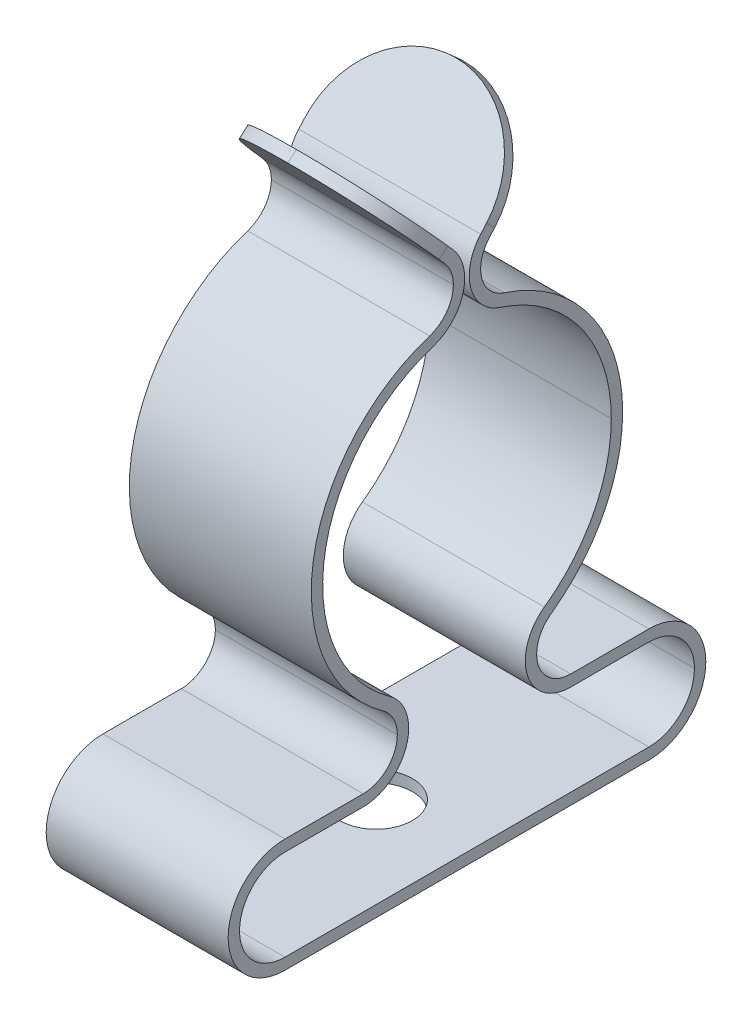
ISO-10303-21;
HEADER;
FILE_DESCRIPTION(('STEP AP214'),'2;1');
FILE_NAME('part.step','',(''),(''),'','','');
FILE_SCHEMA(('AUTOMOTIVE_DESIGN { 1 0 10303 214 1 1 1 1 }'));
ENDSEC;
DATA;
#1=APPLICATION_CONTEXT('core data for automotive mechanical design processes');
#2=APPLICATION_PROTOCOL_DEFINITION('international standard','automotive_design',2000,#1);
#3=PRODUCT_CONTEXT('',#1,'mechanical');
#4=PRODUCT('Part','Part','',(#3));
#5=PRODUCT_RELATED_PRODUCT_CATEGORY('part','',(#4));
#6=PRODUCT_DEFINITION_FORMATION('','',#4);
#7=PRODUCT_DEFINITION_CONTEXT('part definition',#1,'design');
#8=PRODUCT_DEFINITION('design','',#6,#7);
#9=PRODUCT_DEFINITION_SHAPE('','',#8);
#10=(LENGTH_UNIT() NAMED_UNIT(*) SI_UNIT(.MILLI.,.METRE.));
#11=(NAMED_UNIT(*) PLANE_ANGLE_UNIT() SI_UNIT($,.RADIAN.));
#12=(NAMED_UNIT(*) SI_UNIT($,.STERADIAN.) SOLID_ANGLE_UNIT());
#13=UNCERTAINTY_MEASURE_WITH_UNIT(LENGTH_MEASURE(1.E-05),#10,'distance_accuracy_value','');
#14=(GEOMETRIC_REPRESENTATION_CONTEXT(3) GLOBAL_UNCERTAINTY_ASSIGNED_CONTEXT((#13)) GLOBAL_UNIT_ASSIGNED_CONTEXT((#10,
#11,#12)) REPRESENTATION_CONTEXT('',''));
#15=CARTESIAN_POINT('',(0.,0.,0.));
#16=DIRECTION('',(0.,0.,1.));
#17=DIRECTION('',(1.,0.,0.));
#18=AXIS2_PLACEMENT_3D('',#15,#16,#17);
#19=CARTESIAN_POINT('',(17.3911017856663,37.8962384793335,19.6169356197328));
#20=DIRECTION('',(0.,-0.662703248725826,0.74888210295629));
#21=DIRECTION('',(0.,0.74888210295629,0.662703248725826));
#22=AXIS2_PLACEMENT_3D('',#19,#20,#21);
#23=CYLINDRICAL_SURFACE('',#22,4.);
#24=CARTESIAN_POINT('',(17.3911017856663,39.2216449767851,18.1191714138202));
#25=DIRECTION('',(0.,0.662703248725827,-0.74888210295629));
#26=DIRECTION('',(0.,-0.74888210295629,-0.662703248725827));
#27=AXIS2_PLACEMENT_3D('',#24,#25,#26);
#28=CIRCLE('',#27,4.);
#29=CARTESIAN_POINT('',(17.3911017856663,42.2171733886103,20.7699844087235));
#30=VERTEX_POINT('',#29);
#31=CARTESIAN_POINT('',(21.3911017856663,39.2216449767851,18.1191714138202));
#32=VERTEX_POINT('',#31);
#33=EDGE_CURVE('E597',#30,#32,#28,.T.);
#34=ORIENTED_EDGE('',*,*,#33,.F.);
#35=DIRECTION('',(0.,-0.662703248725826,0.74888210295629));
#36=VECTOR('',#35,1.);
#37=CARTESIAN_POINT('',(17.3911017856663,41.8858217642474,21.1444254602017));
#38=LINE('',#37,#36);
#39=CARTESIAN_POINT('',(17.3911017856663,41.8858217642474,21.1444254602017));
#40=VERTEX_POINT('',#39);
#41=EDGE_CURVE('E10',#30,#40,#38,.T.);
#42=ORIENTED_EDGE('',*,*,#41,.T.);
#43=CARTESIAN_POINT('',(17.3911017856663,38.8902933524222,18.4936124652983));
#44=DIRECTION('',(0.,-0.662703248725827,0.74888210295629));
#45=DIRECTION('',(0.,-0.74888210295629,-0.662703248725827));
#46=AXIS2_PLACEMENT_3D('',#43,#44,#45);
#47=CIRCLE('',#46,4.);
#48=CARTESIAN_POINT('',(21.3911017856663,38.8902933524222,18.4936124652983));
#49=VERTEX_POINT('',#48);
#50=EDGE_CURVE('E567',#49,#40,#47,.T.);
#51=ORIENTED_EDGE('',*,*,#50,.F.);
#52=DIRECTION('',(0.,-0.662703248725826,0.74888210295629));
#53=VECTOR('',#52,1.);
#54=CARTESIAN_POINT('',(21.3911017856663,37.8962384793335,19.6169356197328));
#55=LINE('',#54,#53);
#56=EDGE_CURVE('E650',#32,#49,#55,.T.);
#57=ORIENTED_EDGE('',*,*,#56,.F.);
#58=EDGE_LOOP('',(#34,#42,#51,#57));
#59=FACE_BOUND('',#58,.T.);
#60=ADVANCED_FACE('F15',(#59),#23,.T.);
#61=CARTESIAN_POINT('',(17.3911017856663,39.2216449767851,18.1191714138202));
#62=DIRECTION('',(0.,0.662703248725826,-0.74888210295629));
#63=DIRECTION('',(0.,-0.74888210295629,-0.662703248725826));
#64=AXIS2_PLACEMENT_3D('',#61,#62,#63);
#65=CYLINDRICAL_SURFACE('',#64,4.);
#66=ORIENTED_EDGE('',*,*,#41,.F.);
#67=CARTESIAN_POINT('',(17.3911017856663,39.2216449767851,18.1191714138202));
#68=DIRECTION('',(0.,0.662703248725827,-0.74888210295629));
#69=DIRECTION('',(0.,-0.74888210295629,-0.662703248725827));
#70=AXIS2_PLACEMENT_3D('',#67,#68,#69);
#71=CIRCLE('',#70,4.);
#72=CARTESIAN_POINT('',(13.3911017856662,39.2216449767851,18.1191714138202));
#73=VERTEX_POINT('',#72);
#74=EDGE_CURVE('E590',#73,#30,#71,.T.);
#75=ORIENTED_EDGE('',*,*,#74,.F.);
#76=DIRECTION('',(0.,0.662703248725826,-0.74888210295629));
#77=VECTOR('',#76,1.);
#78=CARTESIAN_POINT('',(13.3911017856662,39.2216449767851,18.1191714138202));
#79=LINE('',#78,#77);
#80=CARTESIAN_POINT('',(13.3911017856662,38.8902933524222,18.4936124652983));
#81=VERTEX_POINT('',#80);
#82=EDGE_CURVE('E502',#81,#73,#79,.T.);
#83=ORIENTED_EDGE('',*,*,#82,.F.);
#84=CARTESIAN_POINT('',(17.3911017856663,38.8902933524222,18.4936124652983));
#85=DIRECTION('',(0.,-0.662703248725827,0.74888210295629));
#86=DIRECTION('',(0.,-0.74888210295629,-0.662703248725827));
#87=AXIS2_PLACEMENT_3D('',#84,#85,#86);
#88=CIRCLE('',#87,4.);
#89=EDGE_CURVE('E575',#40,#81,#88,.T.);
#90=ORIENTED_EDGE('',*,*,#89,.F.);
#91=EDGE_LOOP('',(#66,#75,#83,#90));
#92=FACE_BOUND('',#91,.T.);
#93=ADVANCED_FACE('F935',(#92),#65,.T.);
#94=CARTESIAN_POINT('',(17.3911017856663,39.9806422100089,17.2784956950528));
#95=DIRECTION('',(0.,0.662703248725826,0.74888210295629));
#96=DIRECTION('',(0.,0.74888210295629,-0.662703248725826));
#97=AXIS2_PLACEMENT_3D('',#94,#95,#96);
#98=CYLINDRICAL_SURFACE('',#97,4.);
#99=CARTESIAN_POINT('',(17.3911017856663,38.8902933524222,16.0463563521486));
#100=DIRECTION('',(0.,-0.662703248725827,-0.74888210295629));
#101=DIRECTION('',(0.,0.74888210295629,-0.662703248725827));
#102=AXIS2_PLACEMENT_3D('',#99,#100,#101);
#103=CIRCLE('',#102,4.);
#104=CARTESIAN_POINT('',(17.3911017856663,41.8858217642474,13.3955433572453));
#105=VERTEX_POINT('',#104);
#106=CARTESIAN_POINT('',(21.3911017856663,38.8902933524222,16.0463563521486));
#107=VERTEX_POINT('',#106);
#108=EDGE_CURVE('E695',#105,#107,#103,.T.);
#109=ORIENTED_EDGE('',*,*,#108,.F.);
#110=DIRECTION('',(0.,0.662703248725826,0.74888210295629));
#111=VECTOR('',#110,1.);
#112=CARTESIAN_POINT('',(17.3911017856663,42.2171733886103,13.7699844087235));
#113=LINE('',#112,#111);
#114=CARTESIAN_POINT('',(17.3911017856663,42.2171733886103,13.7699844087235));
#115=VERTEX_POINT('',#114);
#116=EDGE_CURVE('E24',#105,#115,#113,.T.);
#117=ORIENTED_EDGE('',*,*,#116,.T.);
#118=CARTESIAN_POINT('',(17.3911017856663,39.2216449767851,16.4207974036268));
#119=DIRECTION('',(0.,0.662703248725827,0.74888210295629));
#120=DIRECTION('',(0.,0.74888210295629,-0.662703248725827));
#121=AXIS2_PLACEMENT_3D('',#118,#119,#120);
#122=CIRCLE('',#121,4.);
#123=CARTESIAN_POINT('',(21.3911017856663,39.2216449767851,16.4207974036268));
#124=VERTEX_POINT('',#123);
#125=EDGE_CURVE('E443',#124,#115,#122,.T.);
#126=ORIENTED_EDGE('',*,*,#125,.F.);
#127=DIRECTION('',(0.,0.662703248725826,0.74888210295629));
#128=VECTOR('',#127,1.);
#129=CARTESIAN_POINT('',(21.3911017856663,39.9806422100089,17.2784956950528));
#130=LINE('',#129,#128);
#131=EDGE_CURVE('E608',#107,#124,#130,.T.);
#132=ORIENTED_EDGE('',*,*,#131,.F.);
#133=EDGE_LOOP('',(#109,#117,#126,#132));
#134=FACE_BOUND('',#133,.T.);
#135=ADVANCED_FACE('F758',(#134),#98,.T.);
#136=CARTESIAN_POINT('',(17.3911017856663,38.8902933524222,16.0463563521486));
#137=DIRECTION('',(0.,-0.662703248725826,-0.74888210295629));
#138=DIRECTION('',(0.,-0.74888210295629,0.662703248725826));
#139=AXIS2_PLACEMENT_3D('',#136,#137,#138);
#140=CYLINDRICAL_SURFACE('',#139,4.);
#141=ORIENTED_EDGE('',*,*,#116,.F.);
#142=CARTESIAN_POINT('',(17.3911017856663,38.8902933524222,16.0463563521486));
#143=DIRECTION('',(0.,-0.662703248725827,-0.74888210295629));
#144=DIRECTION('',(0.,0.74888210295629,-0.662703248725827));
#145=AXIS2_PLACEMENT_3D('',#142,#143,#144);
#146=CIRCLE('',#145,4.);
#147=CARTESIAN_POINT('',(13.3911017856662,38.8902933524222,16.0463563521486));
#148=VERTEX_POINT('',#147);
#149=EDGE_CURVE('E468',#148,#105,#146,.T.);
#150=ORIENTED_EDGE('',*,*,#149,.F.);
#151=DIRECTION('',(0.,-0.662703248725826,-0.74888210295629));
#152=VECTOR('',#151,1.);
#153=CARTESIAN_POINT('',(13.3911017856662,38.8902933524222,16.0463563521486));
#154=LINE('',#153,#152);
#155=CARTESIAN_POINT('',(13.3911017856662,39.2216449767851,16.4207974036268));
#156=VERTEX_POINT('',#155);
#157=EDGE_CURVE('E499',#156,#148,#154,.T.);
#158=ORIENTED_EDGE('',*,*,#157,.F.);
#159=CARTESIAN_POINT('',(17.3911017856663,39.2216449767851,16.4207974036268));
#160=DIRECTION('',(0.,0.662703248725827,0.74888210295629));
#161=DIRECTION('',(0.,0.74888210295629,-0.662703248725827));
#162=AXIS2_PLACEMENT_3D('',#159,#160,#161);
#163=CIRCLE('',#162,4.);
#164=EDGE_CURVE('E447',#115,#156,#163,.T.);
#165=ORIENTED_EDGE('',*,*,#164,.F.);
#166=EDGE_LOOP('',(#141,#150,#158,#165));
#167=FACE_BOUND('',#166,.T.);
#168=ADVANCED_FACE('F762',(#167),#140,.T.);
#169=CARTESIAN_POINT('',(17.3911017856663,20.2426567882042,17.2699844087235));
#170=DIRECTION('',(0.,-1.,0.));
#171=DIRECTION('',(1.,0.,0.));
#172=AXIS2_PLACEMENT_3D('',#169,#170,#171);
#173=CYLINDRICAL_SURFACE('',#172,1.6);
#174=DIRECTION('',(0.,-1.,0.));
#175=VECTOR('',#174,1.);
#176=CARTESIAN_POINT('',(15.7911017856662,20.2426567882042,17.2699844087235));
#177=LINE('',#176,#175);
#178=CARTESIAN_POINT('',(15.7911017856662,15.7171733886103,17.2699844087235));
#179=VERTEX_POINT('',#178);
#180=CARTESIAN_POINT('',(15.7911017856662,15.2171733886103,17.2699844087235));
#181=VERTEX_POINT('',#180);
#182=EDGE_CURVE('E905',#179,#181,#177,.T.);
#183=ORIENTED_EDGE('',*,*,#182,.F.);
#184=CARTESIAN_POINT('',(17.3911017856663,15.7171733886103,17.2699844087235));
#185=DIRECTION('',(0.,-1.,0.));
#186=DIRECTION('',(-1.,0.,0.));
#187=AXIS2_PLACEMENT_3D('',#184,#185,#186);
#188=CIRCLE('',#187,1.6);
#189=CARTESIAN_POINT('',(18.9911017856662,15.7171733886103,17.2699844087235));
#190=VERTEX_POINT('',#189);
#191=EDGE_CURVE('E396',#190,#179,#188,.T.);
#192=ORIENTED_EDGE('',*,*,#191,.F.);
#193=DIRECTION('',(0.,-1.,0.));
#194=VECTOR('',#193,1.);
#195=CARTESIAN_POINT('',(18.9911017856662,20.2426567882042,17.2699844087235));
#196=LINE('',#195,#194);
#197=CARTESIAN_POINT('',(18.9911017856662,15.2171733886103,17.2699844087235));
#198=VERTEX_POINT('',#197);
#199=EDGE_CURVE('E387',#190,#198,#196,.T.);
#200=ORIENTED_EDGE('',*,*,#199,.T.);
#201=CARTESIAN_POINT('',(17.3911017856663,15.2171733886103,17.2699844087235));
#202=DIRECTION('',(0.,-1.,0.));
#203=DIRECTION('',(1.,0.,0.));
#204=AXIS2_PLACEMENT_3D('',#201,#202,#203);
#205=CIRCLE('',#204,1.6);
#206=EDGE_CURVE('E358',#198,#181,#205,.T.);
#207=ORIENTED_EDGE('',*,*,#206,.T.);
#208=EDGE_LOOP('',(#183,#192,#200,#207));
#209=FACE_BOUND('',#208,.T.);
#210=ADVANCED_FACE('F947',(#209),#173,.F.);
#211=CARTESIAN_POINT('',(21.3911017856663,37.6171733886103,19.3699844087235));
#212=DIRECTION('',(1.,0.,0.));
#213=DIRECTION('',(0.,-1.,0.));
#214=AXIS2_PLACEMENT_3D('',#211,#212,#213);
#215=PLANE('',#214);
#216=DIRECTION('',(0.,-0.74888210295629,0.662703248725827));
#217=VECTOR('',#216,1.);
#218=CARTESIAN_POINT('',(21.3911017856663,38.611228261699,16.2933075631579));
#219=LINE('',#218,#217);
#220=CARTESIAN_POINT('',(21.3911017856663,38.611228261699,16.2933075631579));
#221=VERTEX_POINT('',#220);
#222=EDGE_CURVE('E485',#107,#221,#219,.T.);
#223=ORIENTED_EDGE('',*,*,#222,.F.);
#224=ORIENTED_EDGE('',*,*,#131,.T.);
#225=DIRECTION('',(0.,-0.74888210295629,0.662703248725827));
#226=VECTOR('',#225,1.);
#227=CARTESIAN_POINT('',(21.3911017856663,38.9425798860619,16.6677486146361));
#228=LINE('',#227,#226);
#229=CARTESIAN_POINT('',(21.3911017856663,38.9425798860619,16.6677486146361));
#230=VERTEX_POINT('',#229);
#231=EDGE_CURVE('E448',#124,#230,#228,.T.);
#232=ORIENTED_EDGE('',*,*,#231,.T.);
#233=CARTESIAN_POINT('',(21.3911017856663,37.6171733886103,15.1699844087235));
#234=DIRECTION('',(1.,0.,0.));
#235=DIRECTION('',(0.,0.,-1.));
#236=AXIS2_PLACEMENT_3D('',#233,#234,#235);
#237=CIRCLE('',#236,2.);
#238=CARTESIAN_POINT('',(21.3911017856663,35.7132651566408,15.7824657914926));
#239=VERTEX_POINT('',#238);
#240=EDGE_CURVE('E668',#230,#239,#237,.T.);
#241=ORIENTED_EDGE('',*,*,#240,.T.);
#242=CARTESIAN_POINT('',(21.3911017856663,29.0495863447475,17.9261506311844));
#243=DIRECTION('',(-1.,0.,0.));
#244=DIRECTION('',(0.,0.,-1.));
#245=AXIS2_PLACEMENT_3D('',#242,#243,#244);
#246=CIRCLE('',#245,7.);
#247=CARTESIAN_POINT('',(21.3911017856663,29.0495863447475,10.9261506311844));
#248=VERTEX_POINT('',#247);
#249=EDGE_CURVE('E490',#239,#248,#246,.T.);
#250=ORIENTED_EDGE('',*,*,#249,.T.);
#251=CARTESIAN_POINT('',(21.3911017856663,29.0495863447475,17.9261506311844));
#252=DIRECTION('',(-1.,0.,0.));
#253=DIRECTION('',(0.,0.,-1.));
#254=AXIS2_PLACEMENT_3D('',#251,#252,#253);
#255=CIRCLE('',#254,7.);
#256=CARTESIAN_POINT('',(21.3911017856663,23.3465984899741,13.8670953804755));
#257=VERTEX_POINT('',#256);
#258=EDGE_CURVE('E593',#248,#257,#255,.T.);
#259=ORIENTED_EDGE('',*,*,#258,.T.);
#260=CARTESIAN_POINT('',(21.3911017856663,21.7171733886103,12.7073653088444));
#261=DIRECTION('',(1.,0.,0.));
#262=DIRECTION('',(0.,0.,1.));
#263=AXIS2_PLACEMENT_3D('',#260,#261,#262);
#264=CIRCLE('',#263,2.);
#265=CARTESIAN_POINT('',(21.3911017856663,19.7171733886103,12.7073653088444));
#266=VERTEX_POINT('',#265);
#267=EDGE_CURVE('E568',#257,#266,#264,.T.);
#268=ORIENTED_EDGE('',*,*,#267,.T.);
#269=DIRECTION('',(0.,0.,-1.));
#270=VECTOR('',#269,1.);
#271=CARTESIAN_POINT('',(21.3911017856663,19.7171733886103,9.26998440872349));
#272=LINE('',#271,#270);
#273=CARTESIAN_POINT('',(21.3911017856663,19.7171733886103,9.26998440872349));
#274=VERTEX_POINT('',#273);
#275=EDGE_CURVE('E547',#266,#274,#272,.T.);
#276=ORIENTED_EDGE('',*,*,#275,.T.);
#277=CARTESIAN_POINT('',(21.3911017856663,17.7171733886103,9.26998440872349));
#278=DIRECTION('',(-1.,0.,0.));
#279=DIRECTION('',(0.,0.,-1.));
#280=AXIS2_PLACEMENT_3D('',#277,#278,#279);
#281=CIRCLE('',#280,2.);
#282=CARTESIAN_POINT('',(21.3911017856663,17.7171733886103,7.2699844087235));
#283=VERTEX_POINT('',#282);
#284=EDGE_CURVE('E514',#274,#283,#281,.T.);
#285=ORIENTED_EDGE('',*,*,#284,.T.);
#286=CARTESIAN_POINT('',(21.3911017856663,17.7171733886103,9.26998440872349));
#287=DIRECTION('',(-1.,0.,0.));
#288=DIRECTION('',(0.,0.,-1.));
#289=AXIS2_PLACEMENT_3D('',#286,#287,#288);
#290=CIRCLE('',#289,2.);
#291=CARTESIAN_POINT('',(21.3911017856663,15.7171733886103,9.26998440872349));
#292=VERTEX_POINT('',#291);
#293=EDGE_CURVE('E551',#283,#292,#290,.T.);
#294=ORIENTED_EDGE('',*,*,#293,.T.);
#295=DIRECTION('',(0.,0.,1.));
#296=VECTOR('',#295,1.);
#297=CARTESIAN_POINT('',(21.3911017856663,15.7171733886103,9.26998440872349));
#298=LINE('',#297,#296);
#299=CARTESIAN_POINT('',(21.3911017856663,15.7171733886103,25.2699844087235));
#300=VERTEX_POINT('',#299);
#301=EDGE_CURVE('E643',#292,#300,#298,.T.);
#302=ORIENTED_EDGE('',*,*,#301,.T.);
#303=CARTESIAN_POINT('',(21.3911017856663,17.7171733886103,25.2699844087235));
#304=DIRECTION('',(-1.,0.,0.));
#305=DIRECTION('',(0.,0.,1.));
#306=AXIS2_PLACEMENT_3D('',#303,#304,#305);
#307=CIRCLE('',#306,2.);
#308=CARTESIAN_POINT('',(21.3911017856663,19.7171733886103,25.2699844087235));
#309=VERTEX_POINT('',#308);
#310=EDGE_CURVE('E635',#300,#309,#307,.T.);
#311=ORIENTED_EDGE('',*,*,#310,.T.);
#312=DIRECTION('',(0.,0.,-1.));
#313=VECTOR('',#312,1.);
#314=CARTESIAN_POINT('',(21.3911017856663,19.7171733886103,25.2699844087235));
#315=LINE('',#314,#313);
#316=CARTESIAN_POINT('',(21.3911017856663,19.7171733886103,21.8326035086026));
#317=VERTEX_POINT('',#316);
#318=EDGE_CURVE('E625',#309,#317,#315,.T.);
#319=ORIENTED_EDGE('',*,*,#318,.T.);
#320=CARTESIAN_POINT('',(21.3911017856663,21.7171733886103,21.8326035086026));
#321=DIRECTION('',(1.,0.,0.));
#322=DIRECTION('',(0.,0.,-1.));
#323=AXIS2_PLACEMENT_3D('',#320,#321,#322);
#324=CIRCLE('',#323,2.);
#325=CARTESIAN_POINT('',(21.3911017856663,21.7171733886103,19.8326035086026));
#326=VERTEX_POINT('',#325);
#327=EDGE_CURVE('E530',#317,#326,#324,.T.);
#328=ORIENTED_EDGE('',*,*,#327,.T.);
#329=CARTESIAN_POINT('',(21.3911017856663,21.7171733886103,21.8326035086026));
#330=DIRECTION('',(1.,0.,0.));
#331=DIRECTION('',(0.,0.,-1.));
#332=AXIS2_PLACEMENT_3D('',#329,#330,#331);
#333=CIRCLE('',#332,2.);
#334=CARTESIAN_POINT('',(21.3911017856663,23.3465984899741,20.6728734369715));
#335=VERTEX_POINT('',#334);
#336=EDGE_CURVE('E385',#326,#335,#333,.T.);
#337=ORIENTED_EDGE('',*,*,#336,.T.);
#338=CARTESIAN_POINT('',(21.3911017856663,29.0495863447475,16.6138181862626));
#339=DIRECTION('',(-1.,0.,0.));
#340=DIRECTION('',(0.,0.,1.));
#341=AXIS2_PLACEMENT_3D('',#338,#339,#340);
#342=CIRCLE('',#341,7.);
#343=CARTESIAN_POINT('',(21.3911017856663,35.7132651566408,18.7575030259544));
#344=VERTEX_POINT('',#343);
#345=EDGE_CURVE('E453',#335,#344,#342,.T.);
#346=ORIENTED_EDGE('',*,*,#345,.T.);
#347=CARTESIAN_POINT('',(21.3911017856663,37.6171733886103,19.3699844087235));
#348=DIRECTION('',(1.,0.,0.));
#349=DIRECTION('',(0.,0.,1.));
#350=AXIS2_PLACEMENT_3D('',#347,#348,#349);
#351=CIRCLE('',#350,2.);
#352=CARTESIAN_POINT('',(21.3911017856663,37.6171733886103,17.3699844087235));
#353=VERTEX_POINT('',#352);
#354=EDGE_CURVE('E546',#344,#353,#351,.T.);
#355=ORIENTED_EDGE('',*,*,#354,.T.);
#356=CARTESIAN_POINT('',(21.3911017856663,37.6171733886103,19.3699844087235));
#357=DIRECTION('',(1.,0.,0.));
#358=DIRECTION('',(0.,0.,1.));
#359=AXIS2_PLACEMENT_3D('',#356,#357,#358);
#360=CIRCLE('',#359,2.);
#361=CARTESIAN_POINT('',(21.3911017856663,38.9425798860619,17.8722202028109));
#362=VERTEX_POINT('',#361);
#363=EDGE_CURVE('E457',#353,#362,#360,.T.);
#364=ORIENTED_EDGE('',*,*,#363,.T.);
#365=DIRECTION('',(0.,0.74888210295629,0.662703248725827));
#366=VECTOR('',#365,1.);
#367=CARTESIAN_POINT('',(21.3911017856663,38.9425798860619,17.8722202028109));
#368=LINE('',#367,#366);
#369=EDGE_CURVE('E601',#362,#32,#368,.T.);
#370=ORIENTED_EDGE('',*,*,#369,.T.);
#371=ORIENTED_EDGE('',*,*,#56,.T.);
#372=DIRECTION('',(0.,0.74888210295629,0.662703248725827));
#373=VECTOR('',#372,1.);
#374=CARTESIAN_POINT('',(21.3911017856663,38.611228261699,18.246661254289));
#375=LINE('',#374,#373);
#376=CARTESIAN_POINT('',(21.3911017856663,38.611228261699,18.246661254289));
#377=VERTEX_POINT('',#376);
#378=EDGE_CURVE('E563',#377,#49,#375,.T.);
#379=ORIENTED_EDGE('',*,*,#378,.F.);
#380=CARTESIAN_POINT('',(21.3911017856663,37.6171733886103,19.3699844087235));
#381=DIRECTION('',(1.,0.,0.));
#382=DIRECTION('',(0.,0.,1.));
#383=AXIS2_PLACEMENT_3D('',#380,#381,#382);
#384=CIRCLE('',#383,1.5);
#385=CARTESIAN_POINT('',(21.3911017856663,37.6171733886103,17.8699844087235));
#386=VERTEX_POINT('',#385);
#387=EDGE_CURVE('E405',#386,#377,#384,.T.);
#388=ORIENTED_EDGE('',*,*,#387,.F.);
#389=CARTESIAN_POINT('',(21.3911017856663,37.6171733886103,19.3699844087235));
#390=DIRECTION('',(1.,0.,0.));
#391=DIRECTION('',(0.,0.,1.));
#392=AXIS2_PLACEMENT_3D('',#389,#390,#391);
#393=CIRCLE('',#392,1.5);
#394=CARTESIAN_POINT('',(21.3911017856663,36.1892422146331,18.9106233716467));
#395=VERTEX_POINT('',#394);
#396=EDGE_CURVE('E478',#395,#386,#393,.T.);
#397=ORIENTED_EDGE('',*,*,#396,.F.);
#398=CARTESIAN_POINT('',(21.3911017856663,29.0495863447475,16.6138181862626));
#399=DIRECTION('',(-1.,0.,0.));
#400=DIRECTION('',(0.,0.,1.));
#401=AXIS2_PLACEMENT_3D('',#398,#399,#400);
#402=CIRCLE('',#401,7.5);
#403=CARTESIAN_POINT('',(21.3911017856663,22.9392422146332,20.9628059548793));
#404=VERTEX_POINT('',#403);
#405=EDGE_CURVE('E464',#404,#395,#402,.T.);
#406=ORIENTED_EDGE('',*,*,#405,.F.);
#407=CARTESIAN_POINT('',(21.3911017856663,21.7171733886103,21.8326035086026));
#408=DIRECTION('',(1.,0.,0.));
#409=DIRECTION('',(0.,0.,1.));
#410=AXIS2_PLACEMENT_3D('',#407,#408,#409);
#411=CIRCLE('',#410,1.5);
#412=CARTESIAN_POINT('',(21.3911017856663,21.7171733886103,20.3326035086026));
#413=VERTEX_POINT('',#412);
#414=EDGE_CURVE('E376',#413,#404,#411,.T.);
#415=ORIENTED_EDGE('',*,*,#414,.F.);
#416=CARTESIAN_POINT('',(21.3911017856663,21.7171733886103,21.8326035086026));
#417=DIRECTION('',(1.,0.,0.));
#418=DIRECTION('',(0.,0.,1.));
#419=AXIS2_PLACEMENT_3D('',#416,#417,#418);
#420=CIRCLE('',#419,1.5);
#421=CARTESIAN_POINT('',(21.3911017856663,20.2171733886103,21.8326035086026));
#422=VERTEX_POINT('',#421);
#423=EDGE_CURVE('E336',#422,#413,#420,.T.);
#424=ORIENTED_EDGE('',*,*,#423,.F.);
#425=DIRECTION('',(0.,0.,-1.));
#426=VECTOR('',#425,1.);
#427=CARTESIAN_POINT('',(21.3911017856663,20.2171733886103,25.2699844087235));
#428=LINE('',#427,#426);
#429=CARTESIAN_POINT('',(21.3911017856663,20.2171733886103,25.2699844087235));
#430=VERTEX_POINT('',#429);
#431=EDGE_CURVE('E326',#430,#422,#428,.T.);
#432=ORIENTED_EDGE('',*,*,#431,.F.);
#433=CARTESIAN_POINT('',(21.3911017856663,17.7171733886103,25.2699844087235));
#434=DIRECTION('',(-1.,0.,0.));
#435=DIRECTION('',(0.,0.,1.));
#436=AXIS2_PLACEMENT_3D('',#433,#434,#435);
#437=CIRCLE('',#436,2.5);
#438=CARTESIAN_POINT('',(21.3911017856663,15.2171733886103,25.2699844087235));
#439=VERTEX_POINT('',#438);
#440=EDGE_CURVE('E332',#439,#430,#437,.T.);
#441=ORIENTED_EDGE('',*,*,#440,.F.);
#442=DIRECTION('',(0.,0.,1.));
#443=VECTOR('',#442,1.);
#444=CARTESIAN_POINT('',(21.3911017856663,15.2171733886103,9.26998440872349));
#445=LINE('',#444,#443);
#446=CARTESIAN_POINT('',(21.3911017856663,15.2171733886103,9.26998440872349));
#447=VERTEX_POINT('',#446);
#448=EDGE_CURVE('E737',#447,#439,#445,.T.);
#449=ORIENTED_EDGE('',*,*,#448,.F.);
#450=CARTESIAN_POINT('',(21.3911017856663,17.7171733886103,9.26998440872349));
#451=DIRECTION('',(-1.,0.,0.));
#452=DIRECTION('',(0.,0.,1.));
#453=AXIS2_PLACEMENT_3D('',#450,#451,#452);
#454=CIRCLE('',#453,2.5);
#455=CARTESIAN_POINT('',(21.3911017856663,17.7171733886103,6.7699844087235));
#456=VERTEX_POINT('',#455);
#457=EDGE_CURVE('E417',#456,#447,#454,.T.);
#458=ORIENTED_EDGE('',*,*,#457,.F.);
#459=CARTESIAN_POINT('',(21.3911017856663,17.7171733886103,9.26998440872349));
#460=DIRECTION('',(-1.,0.,0.));
#461=DIRECTION('',(0.,0.,1.));
#462=AXIS2_PLACEMENT_3D('',#459,#460,#461);
#463=CIRCLE('',#462,2.5);
#464=CARTESIAN_POINT('',(21.3911017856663,20.2171733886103,9.26998440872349));
#465=VERTEX_POINT('',#464);
#466=EDGE_CURVE('E734',#465,#456,#463,.T.);
#467=ORIENTED_EDGE('',*,*,#466,.F.);
#468=DIRECTION('',(0.,0.,-1.));
#469=VECTOR('',#468,1.);
#470=CARTESIAN_POINT('',(21.3911017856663,20.2171733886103,9.26998440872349));
#471=LINE('',#470,#469);
#472=CARTESIAN_POINT('',(21.3911017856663,20.2171733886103,12.7073653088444));
#473=VERTEX_POINT('',#472);
#474=EDGE_CURVE('E662',#473,#465,#471,.T.);
#475=ORIENTED_EDGE('',*,*,#474,.F.);
#476=CARTESIAN_POINT('',(21.3911017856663,21.7171733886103,12.7073653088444));
#477=DIRECTION('',(1.,0.,0.));
#478=DIRECTION('',(0.,0.,1.));
#479=AXIS2_PLACEMENT_3D('',#476,#477,#478);
#480=CIRCLE('',#479,1.5);
#481=CARTESIAN_POINT('',(21.3911017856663,22.9392422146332,13.5771628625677));
#482=VERTEX_POINT('',#481);
#483=EDGE_CURVE('E523',#482,#473,#480,.T.);
#484=ORIENTED_EDGE('',*,*,#483,.F.);
#485=CARTESIAN_POINT('',(21.3911017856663,29.0495863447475,17.9261506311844));
#486=DIRECTION('',(-1.,0.,0.));
#487=DIRECTION('',(0.,0.,1.));
#488=AXIS2_PLACEMENT_3D('',#485,#486,#487);
#489=CIRCLE('',#488,7.5);
#490=CARTESIAN_POINT('',(21.3911017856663,29.0495863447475,10.4261506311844));
#491=VERTEX_POINT('',#490);
#492=EDGE_CURVE('E452',#491,#482,#489,.T.);
#493=ORIENTED_EDGE('',*,*,#492,.F.);
#494=CARTESIAN_POINT('',(21.3911017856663,29.0495863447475,17.9261506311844));
#495=DIRECTION('',(-1.,0.,0.));
#496=DIRECTION('',(0.,0.,1.));
#497=AXIS2_PLACEMENT_3D('',#494,#495,#496);
#498=CIRCLE('',#497,7.5);
#499=CARTESIAN_POINT('',(21.3911017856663,36.1892422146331,15.6293454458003));
#500=VERTEX_POINT('',#499);
#501=EDGE_CURVE('E716',#500,#491,#498,.T.);
#502=ORIENTED_EDGE('',*,*,#501,.F.);
#503=CARTESIAN_POINT('',(21.3911017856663,37.6171733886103,15.1699844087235));
#504=DIRECTION('',(1.,0.,0.));
#505=DIRECTION('',(0.,0.,1.));
#506=AXIS2_PLACEMENT_3D('',#503,#504,#505);
#507=CIRCLE('',#506,1.5);
#508=EDGE_CURVE('E494',#221,#500,#507,.T.);
#509=ORIENTED_EDGE('',*,*,#508,.F.);
#510=EDGE_LOOP('',(#223,#224,#232,#241,#250,#259,#268,#276,#285,#294,#302,#311,#319,#328,#337,
#346,#355,#364,#370,#371,#379,#388,#397,#406,#415,#424,#432,#441,#449,#458,#467,#475,#484,#493,
#502,#509));
#511=FACE_BOUND('',#510,.T.);
#512=ADVANCED_FACE('F329',(#511),#215,.T.);
#513=CARTESIAN_POINT('',(13.3911017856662,37.6171733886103,19.3699844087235));
#514=DIRECTION('',(1.,0.,0.));
#515=DIRECTION('',(0.,-1.,0.));
#516=AXIS2_PLACEMENT_3D('',#513,#514,#515);
#517=PLANE('',#516);
#518=DIRECTION('',(0.,-0.74888210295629,0.662703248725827));
#519=VECTOR('',#518,1.);
#520=CARTESIAN_POINT('',(13.3911017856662,38.9425798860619,16.6677486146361));
#521=LINE('',#520,#519);
#522=CARTESIAN_POINT('',(13.3911017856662,38.9425798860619,16.6677486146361));
#523=VERTEX_POINT('',#522);
#524=EDGE_CURVE('E465',#156,#523,#521,.T.);
#525=ORIENTED_EDGE('',*,*,#524,.F.);
#526=ORIENTED_EDGE('',*,*,#157,.T.);
#527=DIRECTION('',(0.,-0.74888210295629,0.662703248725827));
#528=VECTOR('',#527,1.);
#529=CARTESIAN_POINT('',(13.3911017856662,38.611228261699,16.2933075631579));
#530=LINE('',#529,#528);
#531=CARTESIAN_POINT('',(13.3911017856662,38.611228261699,16.2933075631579));
#532=VERTEX_POINT('',#531);
#533=EDGE_CURVE('E484',#148,#532,#530,.T.);
#534=ORIENTED_EDGE('',*,*,#533,.T.);
#535=CARTESIAN_POINT('',(13.3911017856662,37.6171733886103,15.1699844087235));
#536=DIRECTION('',(1.,0.,0.));
#537=DIRECTION('',(0.,0.,1.));
#538=AXIS2_PLACEMENT_3D('',#535,#536,#537);
#539=CIRCLE('',#538,1.5);
#540=CARTESIAN_POINT('',(13.3911017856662,36.1892422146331,15.6293454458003));
#541=VERTEX_POINT('',#540);
#542=EDGE_CURVE('E709',#532,#541,#539,.T.);
#543=ORIENTED_EDGE('',*,*,#542,.T.);
#544=CARTESIAN_POINT('',(13.3911017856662,29.0495863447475,17.9261506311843));
#545=DIRECTION('',(-1.,0.,0.));
#546=DIRECTION('',(0.,0.,1.));
#547=AXIS2_PLACEMENT_3D('',#544,#545,#546);
#548=CIRCLE('',#547,7.5);
#549=CARTESIAN_POINT('',(13.3911017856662,29.0495863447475,10.4261506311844));
#550=VERTEX_POINT('',#549);
#551=EDGE_CURVE('E713',#541,#550,#548,.T.);
#552=ORIENTED_EDGE('',*,*,#551,.T.);
#553=CARTESIAN_POINT('',(13.3911017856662,29.0495863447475,17.9261506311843));
#554=DIRECTION('',(-1.,0.,0.));
#555=DIRECTION('',(0.,0.,1.));
#556=AXIS2_PLACEMENT_3D('',#553,#554,#555);
#557=CIRCLE('',#556,7.5);
#558=CARTESIAN_POINT('',(13.3911017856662,22.9392422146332,13.5771628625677));
#559=VERTEX_POINT('',#558);
#560=EDGE_CURVE('E436',#550,#559,#557,.T.);
#561=ORIENTED_EDGE('',*,*,#560,.T.);
#562=CARTESIAN_POINT('',(13.3911017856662,21.7171733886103,12.7073653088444));
#563=DIRECTION('',(1.,0.,0.));
#564=DIRECTION('',(0.,0.,1.));
#565=AXIS2_PLACEMENT_3D('',#562,#563,#564);
#566=CIRCLE('',#565,1.5);
#567=CARTESIAN_POINT('',(13.3911017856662,20.2171733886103,12.7073653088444));
#568=VERTEX_POINT('',#567);
#569=EDGE_CURVE('E522',#559,#568,#566,.T.);
#570=ORIENTED_EDGE('',*,*,#569,.T.);
#571=DIRECTION('',(0.,0.,-1.));
#572=VECTOR('',#571,1.);
#573=CARTESIAN_POINT('',(13.3911017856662,20.2171733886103,9.26998440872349));
#574=LINE('',#573,#572);
#575=CARTESIAN_POINT('',(13.3911017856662,20.2171733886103,9.26998440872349));
#576=VERTEX_POINT('',#575);
#577=EDGE_CURVE('E661',#568,#576,#574,.T.);
#578=ORIENTED_EDGE('',*,*,#577,.T.);
#579=CARTESIAN_POINT('',(13.3911017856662,17.7171733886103,9.26998440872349));
#580=DIRECTION('',(-1.,0.,0.));
#581=DIRECTION('',(0.,0.,1.));
#582=AXIS2_PLACEMENT_3D('',#579,#580,#581);
#583=CIRCLE('',#582,2.5);
#584=CARTESIAN_POINT('',(13.3911017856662,17.7171733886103,6.76998440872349));
#585=VERTEX_POINT('',#584);
#586=EDGE_CURVE('E731',#576,#585,#583,.T.);
#587=ORIENTED_EDGE('',*,*,#586,.T.);
#588=CARTESIAN_POINT('',(13.3911017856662,17.7171733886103,9.26998440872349));
#589=DIRECTION('',(-1.,0.,0.));
#590=DIRECTION('',(0.,0.,1.));
#591=AXIS2_PLACEMENT_3D('',#588,#589,#590);
#592=CIRCLE('',#591,2.5);
#593=CARTESIAN_POINT('',(13.3911017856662,15.2171733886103,9.26998440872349));
#594=VERTEX_POINT('',#593);
#595=EDGE_CURVE('E429',#585,#594,#592,.T.);
#596=ORIENTED_EDGE('',*,*,#595,.T.);
#597=DIRECTION('',(0.,0.,1.));
#598=VECTOR('',#597,1.);
#599=CARTESIAN_POINT('',(13.3911017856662,15.2171733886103,9.26998440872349));
#600=LINE('',#599,#598);
#601=CARTESIAN_POINT('',(13.3911017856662,15.2171733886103,25.2699844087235));
#602=VERTEX_POINT('',#601);
#603=EDGE_CURVE('E365',#594,#602,#600,.T.);
#604=ORIENTED_EDGE('',*,*,#603,.T.);
#605=CARTESIAN_POINT('',(13.3911017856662,17.7171733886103,25.2699844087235));
#606=DIRECTION('',(-1.,0.,0.));
#607=DIRECTION('',(0.,0.,1.));
#608=AXIS2_PLACEMENT_3D('',#605,#606,#607);
#609=CIRCLE('',#608,2.5);
#610=CARTESIAN_POINT('',(13.3911017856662,20.2171733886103,25.2699844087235));
#611=VERTEX_POINT('',#610);
#612=EDGE_CURVE('E342',#602,#611,#609,.T.);
#613=ORIENTED_EDGE('',*,*,#612,.T.);
#614=DIRECTION('',(0.,0.,-1.));
#615=VECTOR('',#614,1.);
#616=CARTESIAN_POINT('',(13.3911017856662,20.2171733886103,25.2699844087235));
#617=LINE('',#616,#615);
#618=CARTESIAN_POINT('',(13.3911017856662,20.2171733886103,21.8326035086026));
#619=VERTEX_POINT('',#618);
#620=EDGE_CURVE('E348',#611,#619,#617,.T.);
#621=ORIENTED_EDGE('',*,*,#620,.T.);
#622=CARTESIAN_POINT('',(13.3911017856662,21.7171733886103,21.8326035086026));
#623=DIRECTION('',(1.,0.,0.));
#624=DIRECTION('',(0.,0.,1.));
#625=AXIS2_PLACEMENT_3D('',#622,#623,#624);
#626=CIRCLE('',#625,1.5);
#627=CARTESIAN_POINT('',(13.3911017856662,21.7171733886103,20.3326035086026));
#628=VERTEX_POINT('',#627);
#629=EDGE_CURVE('E406',#619,#628,#626,.T.);
#630=ORIENTED_EDGE('',*,*,#629,.T.);
#631=CARTESIAN_POINT('',(13.3911017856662,21.7171733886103,21.8326035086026));
#632=DIRECTION('',(1.,0.,0.));
#633=DIRECTION('',(0.,0.,1.));
#634=AXIS2_PLACEMENT_3D('',#631,#632,#633);
#635=CIRCLE('',#634,1.5);
#636=CARTESIAN_POINT('',(13.3911017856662,22.9392422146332,20.9628059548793));
#637=VERTEX_POINT('',#636);
#638=EDGE_CURVE('E416',#628,#637,#635,.T.);
#639=ORIENTED_EDGE('',*,*,#638,.T.);
#640=CARTESIAN_POINT('',(13.3911017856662,29.0495863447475,16.6138181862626));
#641=DIRECTION('',(-1.,0.,0.));
#642=DIRECTION('',(0.,0.,1.));
#643=AXIS2_PLACEMENT_3D('',#640,#641,#642);
#644=CIRCLE('',#643,7.5);
#645=CARTESIAN_POINT('',(13.3911017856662,36.1892422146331,18.9106233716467));
#646=VERTEX_POINT('',#645);
#647=EDGE_CURVE('E479',#637,#646,#644,.T.);
#648=ORIENTED_EDGE('',*,*,#647,.T.);
#649=CARTESIAN_POINT('',(13.3911017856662,37.6171733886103,19.3699844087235));
#650=DIRECTION('',(1.,0.,0.));
#651=DIRECTION('',(0.,0.,1.));
#652=AXIS2_PLACEMENT_3D('',#649,#650,#651);
#653=CIRCLE('',#652,1.5);
#654=CARTESIAN_POINT('',(13.3911017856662,37.6171733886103,17.8699844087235));
#655=VERTEX_POINT('',#654);
#656=EDGE_CURVE('E37',#646,#655,#653,.T.);
#657=ORIENTED_EDGE('',*,*,#656,.T.);
#658=CARTESIAN_POINT('',(13.3911017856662,37.6171733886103,19.3699844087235));
#659=DIRECTION('',(1.,0.,0.));
#660=DIRECTION('',(0.,0.,1.));
#661=AXIS2_PLACEMENT_3D('',#658,#659,#660);
#662=CIRCLE('',#661,1.5);
#663=CARTESIAN_POINT('',(13.3911017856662,38.611228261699,18.246661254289));
#664=VERTEX_POINT('',#663);
#665=EDGE_CURVE('E391',#655,#664,#662,.T.);
#666=ORIENTED_EDGE('',*,*,#665,.T.);
#667=DIRECTION('',(0.,0.74888210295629,0.662703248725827));
#668=VECTOR('',#667,1.);
#669=CARTESIAN_POINT('',(13.3911017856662,38.611228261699,18.246661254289));
#670=LINE('',#669,#668);
#671=EDGE_CURVE('E583',#664,#81,#670,.T.);
#672=ORIENTED_EDGE('',*,*,#671,.T.);
#673=ORIENTED_EDGE('',*,*,#82,.T.);
#674=DIRECTION('',(0.,0.74888210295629,0.662703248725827));
#675=VECTOR('',#674,1.);
#676=CARTESIAN_POINT('',(13.3911017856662,38.9425798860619,17.8722202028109));
#677=LINE('',#676,#675);
#678=CARTESIAN_POINT('',(13.3911017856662,38.9425798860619,17.8722202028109));
#679=VERTEX_POINT('',#678);
#680=EDGE_CURVE('E612',#679,#73,#677,.T.);
#681=ORIENTED_EDGE('',*,*,#680,.F.);
#682=CARTESIAN_POINT('',(13.3911017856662,37.6171733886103,19.3699844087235));
#683=DIRECTION('',(1.,0.,0.));
#684=DIRECTION('',(0.,0.,1.));
#685=AXIS2_PLACEMENT_3D('',#682,#683,#684);
#686=CIRCLE('',#685,2.);
#687=CARTESIAN_POINT('',(13.3911017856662,37.6171733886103,17.3699844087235));
#688=VERTEX_POINT('',#687);
#689=EDGE_CURVE('E616',#688,#679,#686,.T.);
#690=ORIENTED_EDGE('',*,*,#689,.F.);
#691=CARTESIAN_POINT('',(13.3911017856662,37.6171733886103,19.3699844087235));
#692=DIRECTION('',(1.,0.,0.));
#693=DIRECTION('',(0.,0.,1.));
#694=AXIS2_PLACEMENT_3D('',#691,#692,#693);
#695=CIRCLE('',#694,2.);
#696=CARTESIAN_POINT('',(13.3911017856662,35.7132651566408,18.7575030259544));
#697=VERTEX_POINT('',#696);
#698=EDGE_CURVE('E538',#697,#688,#695,.T.);
#699=ORIENTED_EDGE('',*,*,#698,.F.);
#700=CARTESIAN_POINT('',(13.3911017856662,29.0495863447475,16.6138181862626));
#701=DIRECTION('',(-1.,0.,0.));
#702=DIRECTION('',(0.,0.,1.));
#703=AXIS2_PLACEMENT_3D('',#700,#701,#702);
#704=CIRCLE('',#703,7.);
#705=CARTESIAN_POINT('',(13.3911017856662,23.3465984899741,20.6728734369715));
#706=VERTEX_POINT('',#705);
#707=EDGE_CURVE('E386',#706,#697,#704,.T.);
#708=ORIENTED_EDGE('',*,*,#707,.F.);
#709=CARTESIAN_POINT('',(13.3911017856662,21.7171733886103,21.8326035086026));
#710=DIRECTION('',(1.,0.,0.));
#711=DIRECTION('',(0.,0.,-1.));
#712=AXIS2_PLACEMENT_3D('',#709,#710,#711);
#713=CIRCLE('',#712,2.);
#714=CARTESIAN_POINT('',(13.3911017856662,21.7171733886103,19.8326035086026));
#715=VERTEX_POINT('',#714);
#716=EDGE_CURVE('E382',#715,#706,#713,.T.);
#717=ORIENTED_EDGE('',*,*,#716,.F.);
#718=CARTESIAN_POINT('',(13.3911017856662,21.7171733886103,21.8326035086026));
#719=DIRECTION('',(1.,0.,0.));
#720=DIRECTION('',(0.,0.,-1.));
#721=AXIS2_PLACEMENT_3D('',#718,#719,#720);
#722=CIRCLE('',#721,2.);
#723=CARTESIAN_POINT('',(13.3911017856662,19.7171733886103,21.8326035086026));
#724=VERTEX_POINT('',#723);
#725=EDGE_CURVE('E371',#724,#715,#722,.T.);
#726=ORIENTED_EDGE('',*,*,#725,.F.);
#727=DIRECTION('',(0.,0.,-1.));
#728=VECTOR('',#727,1.);
#729=CARTESIAN_POINT('',(13.3911017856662,19.7171733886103,25.2699844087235));
#730=LINE('',#729,#728);
#731=CARTESIAN_POINT('',(13.3911017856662,19.7171733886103,25.2699844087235));
#732=VERTEX_POINT('',#731);
#733=EDGE_CURVE('E632',#732,#724,#730,.T.);
#734=ORIENTED_EDGE('',*,*,#733,.F.);
#735=CARTESIAN_POINT('',(13.3911017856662,17.7171733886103,25.2699844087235));
#736=DIRECTION('',(-1.,0.,0.));
#737=DIRECTION('',(0.,0.,1.));
#738=AXIS2_PLACEMENT_3D('',#735,#736,#737);
#739=CIRCLE('',#738,2.);
#740=CARTESIAN_POINT('',(13.3911017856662,15.7171733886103,25.2699844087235));
#741=VERTEX_POINT('',#740);
#742=EDGE_CURVE('E642',#741,#732,#739,.T.);
#743=ORIENTED_EDGE('',*,*,#742,.F.);
#744=DIRECTION('',(0.,0.,1.));
#745=VECTOR('',#744,1.);
#746=CARTESIAN_POINT('',(13.3911017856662,15.7171733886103,9.26998440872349));
#747=LINE('',#746,#745);
#748=CARTESIAN_POINT('',(13.3911017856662,15.7171733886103,9.26998440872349));
#749=VERTEX_POINT('',#748);
#750=EDGE_CURVE('E401',#749,#741,#747,.T.);
#751=ORIENTED_EDGE('',*,*,#750,.F.);
#752=CARTESIAN_POINT('',(13.3911017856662,17.7171733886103,9.26998440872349));
#753=DIRECTION('',(-1.,0.,0.));
#754=DIRECTION('',(0.,0.,-1.));
#755=AXIS2_PLACEMENT_3D('',#752,#753,#754);
#756=CIRCLE('',#755,2.);
#757=CARTESIAN_POINT('',(13.3911017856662,17.7171733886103,7.26998440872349));
#758=VERTEX_POINT('',#757);
#759=EDGE_CURVE('E400',#758,#749,#756,.T.);
#760=ORIENTED_EDGE('',*,*,#759,.F.);
#761=CARTESIAN_POINT('',(13.3911017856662,17.7171733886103,9.26998440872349));
#762=DIRECTION('',(-1.,0.,0.));
#763=DIRECTION('',(0.,0.,-1.));
#764=AXIS2_PLACEMENT_3D('',#761,#762,#763);
#765=CIRCLE('',#764,2.);
#766=CARTESIAN_POINT('',(13.3911017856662,19.7171733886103,9.26998440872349));
#767=VERTEX_POINT('',#766);
#768=EDGE_CURVE('E506',#767,#758,#765,.T.);
#769=ORIENTED_EDGE('',*,*,#768,.F.);
#770=DIRECTION('',(0.,0.,-1.));
#771=VECTOR('',#770,1.);
#772=CARTESIAN_POINT('',(13.3911017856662,19.7171733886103,9.26998440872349));
#773=LINE('',#772,#771);
#774=CARTESIAN_POINT('',(13.3911017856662,19.7171733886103,12.7073653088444));
#775=VERTEX_POINT('',#774);
#776=EDGE_CURVE('E559',#775,#767,#773,.T.);
#777=ORIENTED_EDGE('',*,*,#776,.F.);
#778=CARTESIAN_POINT('',(13.3911017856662,21.7171733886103,12.7073653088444));
#779=DIRECTION('',(1.,0.,0.));
#780=DIRECTION('',(0.,0.,1.));
#781=AXIS2_PLACEMENT_3D('',#778,#779,#780);
#782=CIRCLE('',#781,2.);
#783=CARTESIAN_POINT('',(13.3911017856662,23.3465984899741,13.8670953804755));
#784=VERTEX_POINT('',#783);
#785=EDGE_CURVE('E579',#784,#775,#782,.T.);
#786=ORIENTED_EDGE('',*,*,#785,.F.);
#787=CARTESIAN_POINT('',(13.3911017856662,29.0495863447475,17.9261506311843));
#788=DIRECTION('',(-1.,0.,0.));
#789=DIRECTION('',(0.,0.,-1.));
#790=AXIS2_PLACEMENT_3D('',#787,#788,#789);
#791=CIRCLE('',#790,7.);
#792=CARTESIAN_POINT('',(13.3911017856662,29.0495863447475,10.9261506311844));
#793=VERTEX_POINT('',#792);
#794=EDGE_CURVE('E586',#793,#784,#791,.T.);
#795=ORIENTED_EDGE('',*,*,#794,.F.);
#796=CARTESIAN_POINT('',(13.3911017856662,29.0495863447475,17.9261506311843));
#797=DIRECTION('',(-1.,0.,0.));
#798=DIRECTION('',(0.,0.,-1.));
#799=AXIS2_PLACEMENT_3D('',#796,#797,#798);
#800=CIRCLE('',#799,7.);
#801=CARTESIAN_POINT('',(13.3911017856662,35.7132651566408,15.7824657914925));
#802=VERTEX_POINT('',#801);
#803=EDGE_CURVE('E475',#802,#793,#800,.T.);
#804=ORIENTED_EDGE('',*,*,#803,.F.);
#805=CARTESIAN_POINT('',(13.3911017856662,37.6171733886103,15.1699844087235));
#806=DIRECTION('',(1.,0.,0.));
#807=DIRECTION('',(0.,0.,-1.));
#808=AXIS2_PLACEMENT_3D('',#805,#806,#807);
#809=CIRCLE('',#808,2.);
#810=EDGE_CURVE('E678',#523,#802,#809,.T.);
#811=ORIENTED_EDGE('',*,*,#810,.F.);
#812=EDGE_LOOP('',(#525,#526,#534,#543,#552,#561,#570,#578,#587,#596,#604,#613,#621,#630,#639,
#648,#657,#666,#672,#673,#681,#690,#699,#708,#717,#726,#734,#743,#751,#760,#769,#777,#786,#795,
#804,#811));
#813=FACE_BOUND('',#812,.T.);
#814=ADVANCED_FACE('F773',(#813),#517,.F.);
#815=CARTESIAN_POINT('',(13.3911017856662,37.6171733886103,19.3699844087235));
#816=DIRECTION('',(1.,0.,0.));
#817=DIRECTION('',(0.,0.,-1.));
#818=AXIS2_PLACEMENT_3D('',#815,#816,#817);
#819=CYLINDRICAL_SURFACE('',#818,1.5);
#820=DIRECTION('',(1.,0.,0.));
#821=VECTOR('',#820,1.);
#822=CARTESIAN_POINT('',(13.3911017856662,37.6171733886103,17.8699844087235));
#823=LINE('',#822,#821);
#824=EDGE_CURVE('E395',#655,#386,#823,.T.);
#825=ORIENTED_EDGE('',*,*,#824,.F.);
#826=ORIENTED_EDGE('',*,*,#656,.F.);
#827=DIRECTION('',(1.,0.,0.));
#828=VECTOR('',#827,1.);
#829=CARTESIAN_POINT('',(13.3911017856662,36.1892422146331,18.9106233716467));
#830=LINE('',#829,#828);
#831=EDGE_CURVE('E691',#646,#395,#830,.T.);
#832=ORIENTED_EDGE('',*,*,#831,.T.);
#833=ORIENTED_EDGE('',*,*,#396,.T.);
#834=EDGE_LOOP('',(#825,#826,#832,#833));
#835=FACE_BOUND('',#834,.T.);
#836=ADVANCED_FACE('F858',(#835),#819,.F.);
#837=CARTESIAN_POINT('',(13.3911017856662,29.0495863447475,16.6138181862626));
#838=DIRECTION('',(1.,0.,0.));
#839=DIRECTION('',(0.,0.,-1.));
#840=AXIS2_PLACEMENT_3D('',#837,#838,#839);
#841=CYLINDRICAL_SURFACE('',#840,7.5);
#842=ORIENTED_EDGE('',*,*,#405,.T.);
#843=ORIENTED_EDGE('',*,*,#831,.F.);
#844=ORIENTED_EDGE('',*,*,#647,.F.);
#845=DIRECTION('',(1.,0.,0.));
#846=VECTOR('',#845,1.);
#847=CARTESIAN_POINT('',(13.3911017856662,22.9392422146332,20.9628059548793));
#848=LINE('',#847,#846);
#849=EDGE_CURVE('E380',#637,#404,#848,.T.);
#850=ORIENTED_EDGE('',*,*,#849,.T.);
#851=EDGE_LOOP('',(#842,#843,#844,#850));
#852=FACE_BOUND('',#851,.T.);
#853=ADVANCED_FACE('F957',(#852),#841,.T.);
#854=CARTESIAN_POINT('',(13.3911017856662,21.7171733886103,21.8326035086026));
#855=DIRECTION('',(1.,0.,0.));
#856=DIRECTION('',(0.,0.,-1.));
#857=AXIS2_PLACEMENT_3D('',#854,#855,#856);
#858=CYLINDRICAL_SURFACE('',#857,1.5);
#859=DIRECTION('',(1.,0.,0.));
#860=VECTOR('',#859,1.);
#861=CARTESIAN_POINT('',(13.3911017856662,21.7171733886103,20.3326035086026));
#862=LINE('',#861,#860);
#863=EDGE_CURVE('E381',#628,#413,#862,.T.);
#864=ORIENTED_EDGE('',*,*,#863,.F.);
#865=ORIENTED_EDGE('',*,*,#629,.F.);
#866=DIRECTION('',(1.,0.,0.));
#867=VECTOR('',#866,1.);
#868=CARTESIAN_POINT('',(13.3911017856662,20.2171733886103,21.8326035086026));
#869=LINE('',#868,#867);
#870=EDGE_CURVE('E341',#619,#422,#869,.T.);
#871=ORIENTED_EDGE('',*,*,#870,.T.);
#872=ORIENTED_EDGE('',*,*,#423,.T.);
#873=EDGE_LOOP('',(#864,#865,#871,#872));
#874=FACE_BOUND('',#873,.T.);
#875=ADVANCED_FACE('F958',(#874),#858,.F.);
#876=CARTESIAN_POINT('',(13.3911017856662,20.2171733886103,25.2699844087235));
#877=DIRECTION('',(0.,-1.,0.));
#878=DIRECTION('',(1.,0.,0.));
#879=AXIS2_PLACEMENT_3D('',#876,#877,#878);
#880=PLANE('',#879);
#881=ORIENTED_EDGE('',*,*,#431,.T.);
#882=ORIENTED_EDGE('',*,*,#870,.F.);
#883=ORIENTED_EDGE('',*,*,#620,.F.);
#884=DIRECTION('',(1.,0.,0.));
#885=VECTOR('',#884,1.);
#886=CARTESIAN_POINT('',(13.3911017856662,20.2171733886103,25.2699844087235));
#887=LINE('',#886,#885);
#888=EDGE_CURVE('E345',#611,#430,#887,.T.);
#889=ORIENTED_EDGE('',*,*,#888,.T.);
#890=EDGE_LOOP('',(#881,#882,#883,#889));
#891=FACE_BOUND('',#890,.T.);
#892=ADVANCED_FACE('F346',(#891),#880,.F.);
#893=CARTESIAN_POINT('',(13.3911017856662,17.7171733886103,25.2699844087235));
#894=DIRECTION('',(1.,0.,0.));
#895=DIRECTION('',(0.,0.,-1.));
#896=AXIS2_PLACEMENT_3D('',#893,#894,#895);
#897=CYLINDRICAL_SURFACE('',#896,2.5);
#898=ORIENTED_EDGE('',*,*,#440,.T.);
#899=ORIENTED_EDGE('',*,*,#888,.F.);
#900=ORIENTED_EDGE('',*,*,#612,.F.);
#901=DIRECTION('',(1.,0.,0.));
#902=VECTOR('',#901,1.);
#903=CARTESIAN_POINT('',(13.3911017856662,15.2171733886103,25.2699844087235));
#904=LINE('',#903,#902);
#905=EDGE_CURVE('E355',#602,#439,#904,.T.);
#906=ORIENTED_EDGE('',*,*,#905,.T.);
#907=EDGE_LOOP('',(#898,#899,#900,#906));
#908=FACE_BOUND('',#907,.T.);
#909=ADVANCED_FACE('F353',(#908),#897,.T.);
#910=CARTESIAN_POINT('',(13.3911017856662,15.2171733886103,9.26998440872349));
#911=DIRECTION('',(0.,1.,0.));
#912=DIRECTION('',(0.,0.,1.));
#913=AXIS2_PLACEMENT_3D('',#910,#911,#912);
#914=PLANE('',#913);
#915=ORIENTED_EDGE('',*,*,#206,.F.);
#916=CARTESIAN_POINT('',(17.3911017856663,15.2171733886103,17.2699844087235));
#917=DIRECTION('',(0.,-1.,0.));
#918=DIRECTION('',(1.,0.,0.));
#919=AXIS2_PLACEMENT_3D('',#916,#917,#918);
#920=CIRCLE('',#919,1.6);
#921=EDGE_CURVE('E369',#181,#198,#920,.T.);
#922=ORIENTED_EDGE('',*,*,#921,.F.);
#923=EDGE_LOOP('',(#915,#922));
#924=FACE_BOUND('',#923,.T.);
#925=ORIENTED_EDGE('',*,*,#448,.T.);
#926=ORIENTED_EDGE('',*,*,#905,.F.);
#927=ORIENTED_EDGE('',*,*,#603,.F.);
#928=DIRECTION('',(1.,0.,0.));
#929=VECTOR('',#928,1.);
#930=CARTESIAN_POINT('',(13.3911017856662,15.2171733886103,9.26998440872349));
#931=LINE('',#930,#929);
#932=EDGE_CURVE('E421',#594,#447,#931,.T.);
#933=ORIENTED_EDGE('',*,*,#932,.T.);
#934=EDGE_LOOP('',(#925,#926,#927,#933));
#935=FACE_BOUND('',#934,.T.);
#936=ADVANCED_FACE('F889',(#924,#935),#914,.F.);
#937=CARTESIAN_POINT('',(13.3911017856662,17.7171733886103,9.26998440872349));
#938=DIRECTION('',(1.,0.,0.));
#939=DIRECTION('',(0.,0.,-1.));
#940=AXIS2_PLACEMENT_3D('',#937,#938,#939);
#941=CYLINDRICAL_SURFACE('',#940,2.5);
#942=DIRECTION('',(1.,0.,0.));
#943=VECTOR('',#942,1.);
#944=CARTESIAN_POINT('',(13.3911017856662,17.7171733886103,6.76998440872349));
#945=LINE('',#944,#943);
#946=EDGE_CURVE('E422',#585,#456,#945,.T.);
#947=ORIENTED_EDGE('',*,*,#946,.F.);
#948=ORIENTED_EDGE('',*,*,#586,.F.);
#949=DIRECTION('',(1.,0.,0.));
#950=VECTOR('',#949,1.);
#951=CARTESIAN_POINT('',(13.3911017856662,20.2171733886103,9.26998440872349));
#952=LINE('',#951,#950);
#953=EDGE_CURVE('E657',#576,#465,#952,.T.);
#954=ORIENTED_EDGE('',*,*,#953,.T.);
#955=ORIENTED_EDGE('',*,*,#466,.T.);
#956=EDGE_LOOP('',(#947,#948,#954,#955));
#957=FACE_BOUND('',#956,.T.);
#958=ADVANCED_FACE('F924',(#957),#941,.T.);
#959=CARTESIAN_POINT('',(13.3911017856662,20.2171733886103,9.26998440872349));
#960=DIRECTION('',(0.,-1.,0.));
#961=DIRECTION('',(1.,0.,0.));
#962=AXIS2_PLACEMENT_3D('',#959,#960,#961);
#963=PLANE('',#962);
#964=ORIENTED_EDGE('',*,*,#474,.T.);
#965=ORIENTED_EDGE('',*,*,#953,.F.);
#966=ORIENTED_EDGE('',*,*,#577,.F.);
#967=DIRECTION('',(1.,0.,0.));
#968=VECTOR('',#967,1.);
#969=CARTESIAN_POINT('',(13.3911017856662,20.2171733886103,12.7073653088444));
#970=LINE('',#969,#968);
#971=EDGE_CURVE('E518',#568,#473,#970,.T.);
#972=ORIENTED_EDGE('',*,*,#971,.T.);
#973=EDGE_LOOP('',(#964,#965,#966,#972));
#974=FACE_BOUND('',#973,.T.);
#975=ADVANCED_FACE('F931',(#974),#963,.F.);
#976=CARTESIAN_POINT('',(13.3911017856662,21.7171733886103,12.7073653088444));
#977=DIRECTION('',(1.,0.,0.));
#978=DIRECTION('',(0.,0.,-1.));
#979=AXIS2_PLACEMENT_3D('',#976,#977,#978);
#980=CYLINDRICAL_SURFACE('',#979,1.5);
#981=ORIENTED_EDGE('',*,*,#483,.T.);
#982=ORIENTED_EDGE('',*,*,#971,.F.);
#983=ORIENTED_EDGE('',*,*,#569,.F.);
#984=DIRECTION('',(1.,0.,0.));
#985=VECTOR('',#984,1.);
#986=CARTESIAN_POINT('',(13.3911017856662,22.9392422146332,13.5771628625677));
#987=LINE('',#986,#985);
#988=EDGE_CURVE('E461',#559,#482,#987,.T.);
#989=ORIENTED_EDGE('',*,*,#988,.T.);
#990=EDGE_LOOP('',(#981,#982,#983,#989));
#991=FACE_BOUND('',#990,.T.);
#992=ADVANCED_FACE('F999',(#991),#980,.F.);
#993=CARTESIAN_POINT('',(13.3911017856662,29.0495863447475,17.9261506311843));
#994=DIRECTION('',(1.,0.,0.));
#995=DIRECTION('',(0.,0.,-1.));
#996=AXIS2_PLACEMENT_3D('',#993,#994,#995);
#997=CYLINDRICAL_SURFACE('',#996,7.5);
#998=DIRECTION('',(1.,0.,0.));
#999=VECTOR('',#998,1.);
#1000=CARTESIAN_POINT('',(13.3911017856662,29.0495863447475,10.4261506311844));
#1001=LINE('',#1000,#999);
#1002=EDGE_CURVE('E440',#550,#491,#1001,.T.);
#1003=ORIENTED_EDGE('',*,*,#1002,.F.);
#1004=ORIENTED_EDGE('',*,*,#551,.F.);
#1005=DIRECTION('',(1.,0.,0.));
#1006=VECTOR('',#1005,1.);
#1007=CARTESIAN_POINT('',(13.3911017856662,36.1892422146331,15.6293454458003));
#1008=LINE('',#1007,#1006);
#1009=EDGE_CURVE('E705',#541,#500,#1008,.T.);
#1010=ORIENTED_EDGE('',*,*,#1009,.T.);
#1011=ORIENTED_EDGE('',*,*,#501,.T.);
#1012=EDGE_LOOP('',(#1003,#1004,#1010,#1011));
#1013=FACE_BOUND('',#1012,.T.);
#1014=ADVANCED_FACE('F1010',(#1013),#997,.T.);
#1015=CARTESIAN_POINT('',(13.3911017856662,37.6171733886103,15.1699844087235));
#1016=DIRECTION('',(1.,0.,0.));
#1017=DIRECTION('',(0.,0.,-1.));
#1018=AXIS2_PLACEMENT_3D('',#1015,#1016,#1017);
#1019=CYLINDRICAL_SURFACE('',#1018,1.5);
#1020=ORIENTED_EDGE('',*,*,#508,.T.);
#1021=ORIENTED_EDGE('',*,*,#1009,.F.);
#1022=ORIENTED_EDGE('',*,*,#542,.F.);
#1023=DIRECTION('',(1.,0.,0.));
#1024=VECTOR('',#1023,1.);
#1025=CARTESIAN_POINT('',(13.3911017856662,38.611228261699,16.2933075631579));
#1026=LINE('',#1025,#1024);
#1027=EDGE_CURVE('E480',#532,#221,#1026,.T.);
#1028=ORIENTED_EDGE('',*,*,#1027,.T.);
#1029=EDGE_LOOP('',(#1020,#1021,#1022,#1028));
#1030=FACE_BOUND('',#1029,.T.);
#1031=ADVANCED_FACE('F1021',(#1030),#1019,.F.);
#1032=CARTESIAN_POINT('',(13.3911017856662,38.611228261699,16.2933075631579));
#1033=DIRECTION('',(0.,0.662703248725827,0.74888210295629));
#1034=DIRECTION('',(1.,0.,0.));
#1035=AXIS2_PLACEMENT_3D('',#1032,#1033,#1034);
#1036=PLANE('',#1035);
#1037=ORIENTED_EDGE('',*,*,#149,.T.);
#1038=ORIENTED_EDGE('',*,*,#108,.T.);
#1039=ORIENTED_EDGE('',*,*,#222,.T.);
#1040=ORIENTED_EDGE('',*,*,#1027,.F.);
#1041=ORIENTED_EDGE('',*,*,#533,.F.);
#1042=EDGE_LOOP('',(#1037,#1038,#1039,#1040,#1041));
#1043=FACE_BOUND('',#1042,.T.);
#1044=ADVANCED_FACE('F770',(#1043),#1036,.F.);
#1045=CARTESIAN_POINT('',(13.3911017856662,38.9425798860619,16.6677486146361));
#1046=DIRECTION('',(0.,0.662703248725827,0.74888210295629));
#1047=DIRECTION('',(1.,0.,0.));
#1048=AXIS2_PLACEMENT_3D('',#1045,#1046,#1047);
#1049=PLANE('',#1048);
#1050=ORIENTED_EDGE('',*,*,#231,.F.);
#1051=ORIENTED_EDGE('',*,*,#125,.T.);
#1052=ORIENTED_EDGE('',*,*,#164,.T.);
#1053=ORIENTED_EDGE('',*,*,#524,.T.);
#1054=DIRECTION('',(1.,0.,0.));
#1055=VECTOR('',#1054,1.);
#1056=CARTESIAN_POINT('',(13.3911017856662,38.9425798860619,16.6677486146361));
#1057=LINE('',#1056,#1055);
#1058=EDGE_CURVE('E672',#523,#230,#1057,.T.);
#1059=ORIENTED_EDGE('',*,*,#1058,.T.);
#1060=EDGE_LOOP('',(#1050,#1051,#1052,#1053,#1059));
#1061=FACE_BOUND('',#1060,.T.);
#1062=ADVANCED_FACE('F765',(#1061),#1049,.T.);
#1063=CARTESIAN_POINT('',(13.3911017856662,37.6171733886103,15.1699844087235));
#1064=DIRECTION('',(1.,0.,0.));
#1065=DIRECTION('',(0.,0.,-1.));
#1066=AXIS2_PLACEMENT_3D('',#1063,#1064,#1065);
#1067=CYLINDRICAL_SURFACE('',#1066,2.);
#1068=ORIENTED_EDGE('',*,*,#240,.F.);
#1069=ORIENTED_EDGE('',*,*,#1058,.F.);
#1070=ORIENTED_EDGE('',*,*,#810,.T.);
#1071=DIRECTION('',(1.,0.,0.));
#1072=VECTOR('',#1071,1.);
#1073=CARTESIAN_POINT('',(13.3911017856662,35.7132651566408,15.7824657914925));
#1074=LINE('',#1073,#1072);
#1075=EDGE_CURVE('E498',#802,#239,#1074,.T.);
#1076=ORIENTED_EDGE('',*,*,#1075,.T.);
#1077=EDGE_LOOP('',(#1068,#1069,#1070,#1076));
#1078=FACE_BOUND('',#1077,.T.);
#1079=ADVANCED_FACE('F780',(#1078),#1067,.T.);
#1080=CARTESIAN_POINT('',(13.3911017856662,29.0495863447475,17.9261506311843));
#1081=DIRECTION('',(1.,0.,0.));
#1082=DIRECTION('',(0.,0.,-1.));
#1083=AXIS2_PLACEMENT_3D('',#1080,#1081,#1082);
#1084=CYLINDRICAL_SURFACE('',#1083,7.);
#1085=DIRECTION('',(1.,0.,0.));
#1086=VECTOR('',#1085,1.);
#1087=CARTESIAN_POINT('',(13.3911017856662,29.0495863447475,10.9261506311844));
#1088=LINE('',#1087,#1086);
#1089=EDGE_CURVE('E486',#793,#248,#1088,.T.);
#1090=ORIENTED_EDGE('',*,*,#1089,.F.);
#1091=ORIENTED_EDGE('',*,*,#794,.T.);
#1092=DIRECTION('',(1.,0.,0.));
#1093=VECTOR('',#1092,1.);
#1094=CARTESIAN_POINT('',(13.3911017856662,23.3465984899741,13.8670953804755));
#1095=LINE('',#1094,#1093);
#1096=EDGE_CURVE('E571',#784,#257,#1095,.T.);
#1097=ORIENTED_EDGE('',*,*,#1096,.T.);
#1098=ORIENTED_EDGE('',*,*,#258,.F.);
#1099=EDGE_LOOP('',(#1090,#1091,#1097,#1098));
#1100=FACE_BOUND('',#1099,.T.);
#1101=ADVANCED_FACE('F788',(#1100),#1084,.F.);
#1102=CARTESIAN_POINT('',(13.3911017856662,21.7171733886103,12.7073653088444));
#1103=DIRECTION('',(1.,0.,0.));
#1104=DIRECTION('',(0.,0.,-1.));
#1105=AXIS2_PLACEMENT_3D('',#1102,#1103,#1104);
#1106=CYLINDRICAL_SURFACE('',#1105,2.);
#1107=ORIENTED_EDGE('',*,*,#267,.F.);
#1108=ORIENTED_EDGE('',*,*,#1096,.F.);
#1109=ORIENTED_EDGE('',*,*,#785,.T.);
#1110=DIRECTION('',(1.,0.,0.));
#1111=VECTOR('',#1110,1.);
#1112=CARTESIAN_POINT('',(13.3911017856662,19.7171733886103,12.7073653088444));
#1113=LINE('',#1112,#1111);
#1114=EDGE_CURVE('E550',#775,#266,#1113,.T.);
#1115=ORIENTED_EDGE('',*,*,#1114,.T.);
#1116=EDGE_LOOP('',(#1107,#1108,#1109,#1115));
#1117=FACE_BOUND('',#1116,.T.);
#1118=ADVANCED_FACE('F791',(#1117),#1106,.T.);
#1119=CARTESIAN_POINT('',(13.3911017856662,19.7171733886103,9.26998440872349));
#1120=DIRECTION('',(0.,-1.,0.));
#1121=DIRECTION('',(1.,0.,0.));
#1122=AXIS2_PLACEMENT_3D('',#1119,#1120,#1121);
#1123=PLANE('',#1122);
#1124=ORIENTED_EDGE('',*,*,#275,.F.);
#1125=ORIENTED_EDGE('',*,*,#1114,.F.);
#1126=ORIENTED_EDGE('',*,*,#776,.T.);
#1127=DIRECTION('',(1.,0.,0.));
#1128=VECTOR('',#1127,1.);
#1129=CARTESIAN_POINT('',(13.3911017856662,19.7171733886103,9.26998440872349));
#1130=LINE('',#1129,#1128);
#1131=EDGE_CURVE('E375',#767,#274,#1130,.T.);
#1132=ORIENTED_EDGE('',*,*,#1131,.T.);
#1133=EDGE_LOOP('',(#1124,#1125,#1126,#1132));
#1134=FACE_BOUND('',#1133,.T.);
#1135=ADVANCED_FACE('F796',(#1134),#1123,.T.);
#1136=CARTESIAN_POINT('',(13.3911017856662,17.7171733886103,9.26998440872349));
#1137=DIRECTION('',(1.,0.,0.));
#1138=DIRECTION('',(0.,0.,-1.));
#1139=AXIS2_PLACEMENT_3D('',#1136,#1137,#1138);
#1140=CYLINDRICAL_SURFACE('',#1139,2.);
#1141=DIRECTION('',(1.,0.,0.));
#1142=VECTOR('',#1141,1.);
#1143=CARTESIAN_POINT('',(13.3911017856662,17.7171733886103,7.26998440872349));
#1144=LINE('',#1143,#1142);
#1145=EDGE_CURVE('E510',#758,#283,#1144,.T.);
#1146=ORIENTED_EDGE('',*,*,#1145,.F.);
#1147=ORIENTED_EDGE('',*,*,#759,.T.);
#1148=DIRECTION('',(1.,0.,0.));
#1149=VECTOR('',#1148,1.);
#1150=CARTESIAN_POINT('',(13.3911017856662,15.7171733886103,9.26998440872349));
#1151=LINE('',#1150,#1149);
#1152=EDGE_CURVE('E646',#749,#292,#1151,.T.);
#1153=ORIENTED_EDGE('',*,*,#1152,.T.);
#1154=ORIENTED_EDGE('',*,*,#293,.F.);
#1155=EDGE_LOOP('',(#1146,#1147,#1153,#1154));
#1156=FACE_BOUND('',#1155,.T.);
#1157=ADVANCED_FACE('F804',(#1156),#1140,.F.);
#1158=CARTESIAN_POINT('',(13.3911017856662,15.7171733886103,9.26998440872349));
#1159=DIRECTION('',(0.,1.,0.));
#1160=DIRECTION('',(0.,0.,1.));
#1161=AXIS2_PLACEMENT_3D('',#1158,#1159,#1160);
#1162=PLANE('',#1161);
#1163=ORIENTED_EDGE('',*,*,#191,.T.);
#1164=CARTESIAN_POINT('',(17.3911017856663,15.7171733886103,17.2699844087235));
#1165=DIRECTION('',(0.,-1.,0.));
#1166=DIRECTION('',(-1.,0.,0.));
#1167=AXIS2_PLACEMENT_3D('',#1164,#1165,#1166);
#1168=CIRCLE('',#1167,1.6);
#1169=EDGE_CURVE('E901',#179,#190,#1168,.T.);
#1170=ORIENTED_EDGE('',*,*,#1169,.T.);
#1171=EDGE_LOOP('',(#1163,#1170));
#1172=FACE_BOUND('',#1171,.T.);
#1173=ORIENTED_EDGE('',*,*,#301,.F.);
#1174=ORIENTED_EDGE('',*,*,#1152,.F.);
#1175=ORIENTED_EDGE('',*,*,#750,.T.);
#1176=DIRECTION('',(1.,0.,0.));
#1177=VECTOR('',#1176,1.);
#1178=CARTESIAN_POINT('',(13.3911017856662,15.7171733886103,25.2699844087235));
#1179=LINE('',#1178,#1177);
#1180=EDGE_CURVE('E638',#741,#300,#1179,.T.);
#1181=ORIENTED_EDGE('',*,*,#1180,.T.);
#1182=EDGE_LOOP('',(#1173,#1174,#1175,#1181));
#1183=FACE_BOUND('',#1182,.T.);
#1184=ADVANCED_FACE('F809',(#1172,#1183),#1162,.T.);
#1185=CARTESIAN_POINT('',(13.3911017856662,17.7171733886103,25.2699844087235));
#1186=DIRECTION('',(1.,0.,0.));
#1187=DIRECTION('',(0.,0.,-1.));
#1188=AXIS2_PLACEMENT_3D('',#1185,#1186,#1187);
#1189=CYLINDRICAL_SURFACE('',#1188,2.);
#1190=ORIENTED_EDGE('',*,*,#310,.F.);
#1191=ORIENTED_EDGE('',*,*,#1180,.F.);
#1192=ORIENTED_EDGE('',*,*,#742,.T.);
#1193=DIRECTION('',(1.,0.,0.));
#1194=VECTOR('',#1193,1.);
#1195=CARTESIAN_POINT('',(13.3911017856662,19.7171733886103,25.2699844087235));
#1196=LINE('',#1195,#1194);
#1197=EDGE_CURVE('E628',#732,#309,#1196,.T.);
#1198=ORIENTED_EDGE('',*,*,#1197,.T.);
#1199=EDGE_LOOP('',(#1190,#1191,#1192,#1198));
#1200=FACE_BOUND('',#1199,.T.);
#1201=ADVANCED_FACE('F815',(#1200),#1189,.F.);
#1202=CARTESIAN_POINT('',(13.3911017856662,19.7171733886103,25.2699844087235));
#1203=DIRECTION('',(0.,-1.,0.));
#1204=DIRECTION('',(1.,0.,0.));
#1205=AXIS2_PLACEMENT_3D('',#1202,#1203,#1204);
#1206=PLANE('',#1205);
#1207=ORIENTED_EDGE('',*,*,#318,.F.);
#1208=ORIENTED_EDGE('',*,*,#1197,.F.);
#1209=ORIENTED_EDGE('',*,*,#733,.T.);
#1210=DIRECTION('',(1.,0.,0.));
#1211=VECTOR('',#1210,1.);
#1212=CARTESIAN_POINT('',(13.3911017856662,19.7171733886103,21.8326035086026));
#1213=LINE('',#1212,#1211);
#1214=EDGE_CURVE('E534',#724,#317,#1213,.T.);
#1215=ORIENTED_EDGE('',*,*,#1214,.T.);
#1216=EDGE_LOOP('',(#1207,#1208,#1209,#1215));
#1217=FACE_BOUND('',#1216,.T.);
#1218=ADVANCED_FACE('F819',(#1217),#1206,.T.);
#1219=CARTESIAN_POINT('',(13.3911017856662,21.7171733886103,21.8326035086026));
#1220=DIRECTION('',(1.,0.,0.));
#1221=DIRECTION('',(0.,0.,-1.));
#1222=AXIS2_PLACEMENT_3D('',#1219,#1220,#1221);
#1223=CYLINDRICAL_SURFACE('',#1222,2.);
#1224=DIRECTION('',(1.,0.,0.));
#1225=VECTOR('',#1224,1.);
#1226=CARTESIAN_POINT('',(13.3911017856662,21.7171733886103,19.8326035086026));
#1227=LINE('',#1226,#1225);
#1228=EDGE_CURVE('E374',#715,#326,#1227,.T.);
#1229=ORIENTED_EDGE('',*,*,#1228,.F.);
#1230=ORIENTED_EDGE('',*,*,#716,.T.);
#1231=DIRECTION('',(1.,0.,0.));
#1232=VECTOR('',#1231,1.);
#1233=CARTESIAN_POINT('',(13.3911017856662,23.3465984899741,20.6728734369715));
#1234=LINE('',#1233,#1232);
#1235=EDGE_CURVE('E456',#706,#335,#1234,.T.);
#1236=ORIENTED_EDGE('',*,*,#1235,.T.);
#1237=ORIENTED_EDGE('',*,*,#336,.F.);
#1238=EDGE_LOOP('',(#1229,#1230,#1236,#1237));
#1239=FACE_BOUND('',#1238,.T.);
#1240=ADVANCED_FACE('F829',(#1239),#1223,.T.);
#1241=CARTESIAN_POINT('',(13.3911017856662,29.0495863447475,16.6138181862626));
#1242=DIRECTION('',(1.,0.,0.));
#1243=DIRECTION('',(0.,0.,-1.));
#1244=AXIS2_PLACEMENT_3D('',#1241,#1242,#1243);
#1245=CYLINDRICAL_SURFACE('',#1244,7.);
#1246=ORIENTED_EDGE('',*,*,#345,.F.);
#1247=ORIENTED_EDGE('',*,*,#1235,.F.);
#1248=ORIENTED_EDGE('',*,*,#707,.T.);
#1249=DIRECTION('',(1.,0.,0.));
#1250=VECTOR('',#1249,1.);
#1251=CARTESIAN_POINT('',(13.3911017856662,35.7132651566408,18.7575030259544));
#1252=LINE('',#1251,#1250);
#1253=EDGE_CURVE('E555',#697,#344,#1252,.T.);
#1254=ORIENTED_EDGE('',*,*,#1253,.T.);
#1255=EDGE_LOOP('',(#1246,#1247,#1248,#1254));
#1256=FACE_BOUND('',#1255,.T.);
#1257=ADVANCED_FACE('F832',(#1256),#1245,.F.);
#1258=CARTESIAN_POINT('',(13.3911017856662,37.6171733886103,19.3699844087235));
#1259=DIRECTION('',(1.,0.,0.));
#1260=DIRECTION('',(0.,0.,-1.));
#1261=AXIS2_PLACEMENT_3D('',#1258,#1259,#1260);
#1262=CYLINDRICAL_SURFACE('',#1261,2.);
#1263=DIRECTION('',(1.,0.,0.));
#1264=VECTOR('',#1263,1.);
#1265=CARTESIAN_POINT('',(13.3911017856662,37.6171733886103,17.3699844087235));
#1266=LINE('',#1265,#1264);
#1267=EDGE_CURVE('E542',#688,#353,#1266,.T.);
#1268=ORIENTED_EDGE('',*,*,#1267,.F.);
#1269=ORIENTED_EDGE('',*,*,#689,.T.);
#1270=DIRECTION('',(1.,0.,0.));
#1271=VECTOR('',#1270,1.);
#1272=CARTESIAN_POINT('',(13.3911017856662,38.9425798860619,17.8722202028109));
#1273=LINE('',#1272,#1271);
#1274=EDGE_CURVE('E605',#679,#362,#1273,.T.);
#1275=ORIENTED_EDGE('',*,*,#1274,.T.);
#1276=ORIENTED_EDGE('',*,*,#363,.F.);
#1277=EDGE_LOOP('',(#1268,#1269,#1275,#1276));
#1278=FACE_BOUND('',#1277,.T.);
#1279=ADVANCED_FACE('F842',(#1278),#1262,.T.);
#1280=CARTESIAN_POINT('',(13.3911017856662,38.9425798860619,17.8722202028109));
#1281=DIRECTION('',(0.,0.662703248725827,-0.74888210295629));
#1282=DIRECTION('',(-1.,0.,0.));
#1283=AXIS2_PLACEMENT_3D('',#1280,#1281,#1282);
#1284=PLANE('',#1283);
#1285=ORIENTED_EDGE('',*,*,#74,.T.);
#1286=ORIENTED_EDGE('',*,*,#33,.T.);
#1287=ORIENTED_EDGE('',*,*,#369,.F.);
#1288=ORIENTED_EDGE('',*,*,#1274,.F.);
#1289=ORIENTED_EDGE('',*,*,#680,.T.);
#1290=EDGE_LOOP('',(#1285,#1286,#1287,#1288,#1289));
#1291=FACE_BOUND('',#1290,.T.);
#1292=ADVANCED_FACE('F845',(#1291),#1284,.T.);
#1293=CARTESIAN_POINT('',(13.3911017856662,38.611228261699,18.246661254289));
#1294=DIRECTION('',(0.,0.662703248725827,-0.74888210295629));
#1295=DIRECTION('',(-1.,0.,0.));
#1296=AXIS2_PLACEMENT_3D('',#1293,#1294,#1295);
#1297=PLANE('',#1296);
#1298=ORIENTED_EDGE('',*,*,#378,.T.);
#1299=ORIENTED_EDGE('',*,*,#50,.T.);
#1300=ORIENTED_EDGE('',*,*,#89,.T.);
#1301=ORIENTED_EDGE('',*,*,#671,.F.);
#1302=DIRECTION('',(1.,0.,0.));
#1303=VECTOR('',#1302,1.);
#1304=CARTESIAN_POINT('',(13.3911017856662,38.611228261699,18.246661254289));
#1305=LINE('',#1304,#1303);
#1306=EDGE_CURVE('E412',#664,#377,#1305,.T.);
#1307=ORIENTED_EDGE('',*,*,#1306,.T.);
#1308=EDGE_LOOP('',(#1298,#1299,#1300,#1301,#1307));
#1309=FACE_BOUND('',#1308,.T.);
#1310=ADVANCED_FACE('F854',(#1309),#1297,.F.);
#1311=CARTESIAN_POINT('',(13.3911017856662,37.6171733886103,19.3699844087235));
#1312=DIRECTION('',(1.,0.,0.));
#1313=DIRECTION('',(0.,0.,-1.));
#1314=AXIS2_PLACEMENT_3D('',#1311,#1312,#1313);
#1315=CYLINDRICAL_SURFACE('',#1314,2.);
#1316=ORIENTED_EDGE('',*,*,#698,.T.);
#1317=ORIENTED_EDGE('',*,*,#1267,.T.);
#1318=ORIENTED_EDGE('',*,*,#354,.F.);
#1319=ORIENTED_EDGE('',*,*,#1253,.F.);
#1320=EDGE_LOOP('',(#1316,#1317,#1318,#1319));
#1321=FACE_BOUND('',#1320,.T.);
#1322=ADVANCED_FACE('F837',(#1321),#1315,.T.);
#1323=CARTESIAN_POINT('',(13.3911017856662,21.7171733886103,21.8326035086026));
#1324=DIRECTION('',(1.,0.,0.));
#1325=DIRECTION('',(0.,0.,-1.));
#1326=AXIS2_PLACEMENT_3D('',#1323,#1324,#1325);
#1327=CYLINDRICAL_SURFACE('',#1326,2.);
#1328=ORIENTED_EDGE('',*,*,#725,.T.);
#1329=ORIENTED_EDGE('',*,*,#1228,.T.);
#1330=ORIENTED_EDGE('',*,*,#327,.F.);
#1331=ORIENTED_EDGE('',*,*,#1214,.F.);
#1332=EDGE_LOOP('',(#1328,#1329,#1330,#1331));
#1333=FACE_BOUND('',#1332,.T.);
#1334=ADVANCED_FACE('F824',(#1333),#1327,.T.);
#1335=CARTESIAN_POINT('',(13.3911017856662,17.7171733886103,9.26998440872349));
#1336=DIRECTION('',(1.,0.,0.));
#1337=DIRECTION('',(0.,0.,-1.));
#1338=AXIS2_PLACEMENT_3D('',#1335,#1336,#1337);
#1339=CYLINDRICAL_SURFACE('',#1338,2.);
#1340=ORIENTED_EDGE('',*,*,#768,.T.);
#1341=ORIENTED_EDGE('',*,*,#1145,.T.);
#1342=ORIENTED_EDGE('',*,*,#284,.F.);
#1343=ORIENTED_EDGE('',*,*,#1131,.F.);
#1344=EDGE_LOOP('',(#1340,#1341,#1342,#1343));
#1345=FACE_BOUND('',#1344,.T.);
#1346=ADVANCED_FACE('F801',(#1345),#1339,.F.);
#1347=CARTESIAN_POINT('',(13.3911017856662,29.0495863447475,17.9261506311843));
#1348=DIRECTION('',(1.,0.,0.));
#1349=DIRECTION('',(0.,0.,-1.));
#1350=AXIS2_PLACEMENT_3D('',#1347,#1348,#1349);
#1351=CYLINDRICAL_SURFACE('',#1350,7.);
#1352=ORIENTED_EDGE('',*,*,#803,.T.);
#1353=ORIENTED_EDGE('',*,*,#1089,.T.);
#1354=ORIENTED_EDGE('',*,*,#249,.F.);
#1355=ORIENTED_EDGE('',*,*,#1075,.F.);
#1356=EDGE_LOOP('',(#1352,#1353,#1354,#1355));
#1357=FACE_BOUND('',#1356,.T.);
#1358=ADVANCED_FACE('F783',(#1357),#1351,.F.);
#1359=CARTESIAN_POINT('',(13.3911017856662,29.0495863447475,17.9261506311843));
#1360=DIRECTION('',(1.,0.,0.));
#1361=DIRECTION('',(0.,0.,-1.));
#1362=AXIS2_PLACEMENT_3D('',#1359,#1360,#1361);
#1363=CYLINDRICAL_SURFACE('',#1362,7.5);
#1364=ORIENTED_EDGE('',*,*,#560,.F.);
#1365=ORIENTED_EDGE('',*,*,#1002,.T.);
#1366=ORIENTED_EDGE('',*,*,#492,.T.);
#1367=ORIENTED_EDGE('',*,*,#988,.F.);
#1368=EDGE_LOOP('',(#1364,#1365,#1366,#1367));
#1369=FACE_BOUND('',#1368,.T.);
#1370=ADVANCED_FACE('F1205',(#1369),#1363,.T.);
#1371=CARTESIAN_POINT('',(13.3911017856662,17.7171733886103,9.26998440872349));
#1372=DIRECTION('',(1.,0.,0.));
#1373=DIRECTION('',(0.,0.,-1.));
#1374=AXIS2_PLACEMENT_3D('',#1371,#1372,#1373);
#1375=CYLINDRICAL_SURFACE('',#1374,2.5);
#1376=ORIENTED_EDGE('',*,*,#595,.F.);
#1377=ORIENTED_EDGE('',*,*,#946,.T.);
#1378=ORIENTED_EDGE('',*,*,#457,.T.);
#1379=ORIENTED_EDGE('',*,*,#932,.F.);
#1380=EDGE_LOOP('',(#1376,#1377,#1378,#1379));
#1381=FACE_BOUND('',#1380,.T.);
#1382=ADVANCED_FACE('F892',(#1381),#1375,.T.);
#1383=CARTESIAN_POINT('',(13.3911017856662,21.7171733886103,21.8326035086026));
#1384=DIRECTION('',(1.,0.,0.));
#1385=DIRECTION('',(0.,0.,-1.));
#1386=AXIS2_PLACEMENT_3D('',#1383,#1384,#1385);
#1387=CYLINDRICAL_SURFACE('',#1386,1.5);
#1388=ORIENTED_EDGE('',*,*,#638,.F.);
#1389=ORIENTED_EDGE('',*,*,#863,.T.);
#1390=ORIENTED_EDGE('',*,*,#414,.T.);
#1391=ORIENTED_EDGE('',*,*,#849,.F.);
#1392=EDGE_LOOP('',(#1388,#1389,#1390,#1391));
#1393=FACE_BOUND('',#1392,.T.);
#1394=ADVANCED_FACE('F1225',(#1393),#1387,.F.);
#1395=CARTESIAN_POINT('',(13.3911017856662,37.6171733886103,19.3699844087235));
#1396=DIRECTION('',(1.,0.,0.));
#1397=DIRECTION('',(0.,0.,-1.));
#1398=AXIS2_PLACEMENT_3D('',#1395,#1396,#1397);
#1399=CYLINDRICAL_SURFACE('',#1398,1.5);
#1400=ORIENTED_EDGE('',*,*,#665,.F.);
#1401=ORIENTED_EDGE('',*,*,#824,.T.);
#1402=ORIENTED_EDGE('',*,*,#387,.T.);
#1403=ORIENTED_EDGE('',*,*,#1306,.F.);
#1404=EDGE_LOOP('',(#1400,#1401,#1402,#1403));
#1405=FACE_BOUND('',#1404,.T.);
#1406=ADVANCED_FACE('F857',(#1405),#1399,.F.);
#1407=CARTESIAN_POINT('',(17.3911017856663,20.2426567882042,17.2699844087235));
#1408=DIRECTION('',(0.,-1.,0.));
#1409=DIRECTION('',(1.,0.,0.));
#1410=AXIS2_PLACEMENT_3D('',#1407,#1408,#1409);
#1411=CYLINDRICAL_SURFACE('',#1410,1.6);
#1412=ORIENTED_EDGE('',*,*,#1169,.F.);
#1413=ORIENTED_EDGE('',*,*,#182,.T.);
#1414=ORIENTED_EDGE('',*,*,#921,.T.);
#1415=ORIENTED_EDGE('',*,*,#199,.F.);
#1416=EDGE_LOOP('',(#1412,#1413,#1414,#1415));
#1417=FACE_BOUND('',#1416,.T.);
#1418=ADVANCED_FACE('F921',(#1417),#1411,.F.);
#1419=CLOSED_SHELL('',(#60,#93,#135,#168,#210,#512,#814,#836,#853,#875,#892,#909,#936,#958,#975,
#992,#1014,#1031,#1044,#1062,#1079,#1101,#1118,#1135,#1157,#1184,#1201,#1218,#1240,#1257,#1279,
#1292,#1310,#1322,#1334,#1346,#1358,#1370,#1382,#1394,#1406,#1418));
#1420=MANIFOLD_SOLID_BREP('B1',#1419);
#1421=ADVANCED_BREP_SHAPE_REPRESENTATION('',(#18,#1420),#14);
#1422=SHAPE_DEFINITION_REPRESENTATION(#9,#1421);
ENDSEC;
END-ISO-10303-21;
